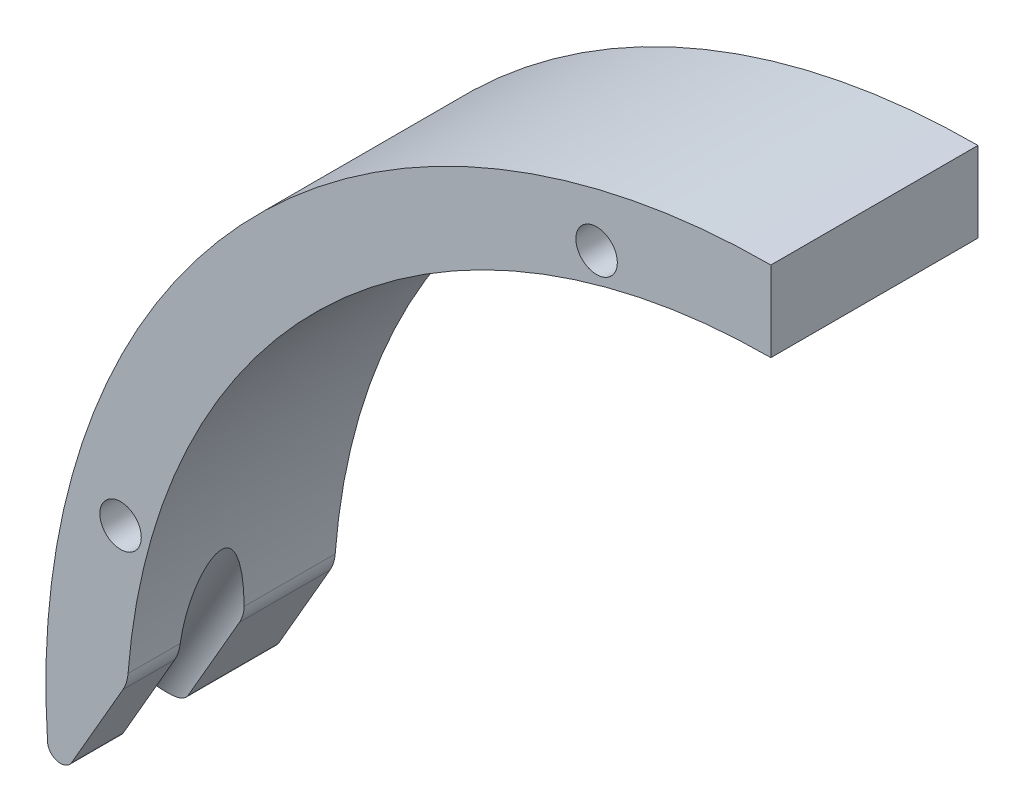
from build123d import *

# Parameters (mm, degrees)
LINEAR_AUSTRAGEN1_DEPTH          = 16
F_3_2_3_2_DURCHMESSER_BOHRUNG1_D = 3.2
LINEAR_AUSTRAGEN5_DEPTH          = 81.796039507
LINEAR_AUSTRAGEN3_DEPTH          = 47
VERRUNDUNG3_R                    = 1
VERRUNDUNG4_R                    = 3


with BuildPart() as part:
    # Skizze1 → Linear austragen1 (new body)
    with BuildSketch(Plane.XY):
        with BuildLine():
            Line((0, 56), (0, 49.8))
            ThreePointArc((0, 49.8), (-35.213917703, 35.213917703), (-49.8, 0))
            Line((-49.8, 0), (-55.210361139, -9.371020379))
            ThreePointArc((-55.210361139, -9.371020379), (-42.783040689, 36.133245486), (0, 56))
        make_face()
    extrude(amount=LINEAR_AUSTRAGEN1_DEPTH)

    # 3.2 _3.2_ Durchmesser Bohrung1 (through all)
    with Locations(Plane.XY.offset(16)):
        with Locations((-50.228142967, 13.458590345), (-13.458590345, 50.228142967)):
            Hole(F_3_2_3_2_DURCHMESSER_BOHRUNG1_D / 2)

    # Skizze8 → Linear austragen5 (cut, through all)
    with BuildSketch(Plane.XY.offset(16)):
        Polygon((-55.210361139, -9.371020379), (-48.322014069, 2.559946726), (-48.322014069, 5.559946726), (-56.942411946, -9.371020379), align=None)
    extrude(amount=-LINEAR_AUSTRAGEN5_DEPTH, mode=Mode.SUBTRACT)

    # Skizze6 → Linear austragen3 (cut)
    with BuildSketch(Plane(origin=(-20.5, -35.507041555, 0), x_dir=(-0.866025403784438, 0.5000000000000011, 0), z_dir=(0.5000000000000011, 0.8660254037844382, 0))):
        with BuildLine():
            Line((44.5, 12), (40.5, 12))
            Line((40.5, 12), (40.5, 7))
            Line((40.5, 7), (44.5, 7))
            ThreePointArc((44.5, 7), (47, 9.5), (44.5, 12))
        make_face()
    extrude(amount=LINEAR_AUSTRAGEN3_DEPTH, mode=Mode.SUBTRACT)

    # Verrundung3
    verrundung3_edges = [part.edges().sort_by_distance(p)[0] for p in [
        (-55.563054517, -6.981903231, 13.998358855),
        (-55.563054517, -6.981903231, 3.501641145),
    ]]
    fillet(verrundung3_edges, radius=VERRUNDUNG3_R)

    # Verrundung4
    verrundung4_edges = [part.edges().sort_by_distance(p)[0] for p in [
        (-49.698651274, 3.175541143, 3.501641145),
        (-49.698651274, 3.175541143, 13.998358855),
    ]]
    fillet(verrundung4_edges, radius=VERRUNDUNG4_R)


solid = part.part
